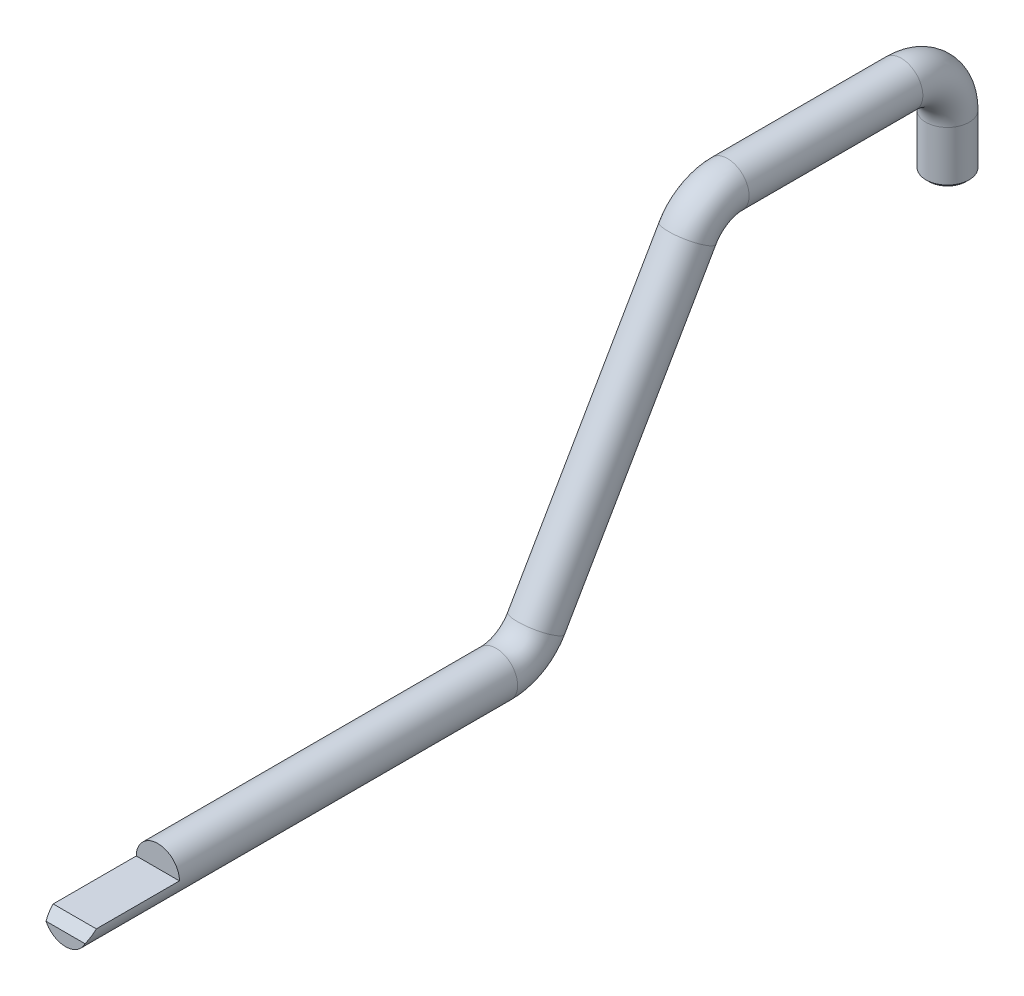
ISO-10303-21;
HEADER;
FILE_DESCRIPTION(('STEP AP214'),'2;1');
FILE_NAME('part.step','',(''),(''),'','','');
FILE_SCHEMA(('AUTOMOTIVE_DESIGN { 1 0 10303 214 1 1 1 1 }'));
ENDSEC;
DATA;
#1=APPLICATION_CONTEXT('core data for automotive mechanical design processes');
#2=APPLICATION_PROTOCOL_DEFINITION('international standard','automotive_design',2000,#1);
#3=PRODUCT_CONTEXT('',#1,'mechanical');
#4=PRODUCT('Part','Part','',(#3));
#5=PRODUCT_RELATED_PRODUCT_CATEGORY('part','',(#4));
#6=PRODUCT_DEFINITION_FORMATION('','',#4);
#7=PRODUCT_DEFINITION_CONTEXT('part definition',#1,'design');
#8=PRODUCT_DEFINITION('design','',#6,#7);
#9=PRODUCT_DEFINITION_SHAPE('','',#8);
#10=(LENGTH_UNIT() NAMED_UNIT(*) SI_UNIT(.MILLI.,.METRE.));
#11=(NAMED_UNIT(*) PLANE_ANGLE_UNIT() SI_UNIT($,.RADIAN.));
#12=(NAMED_UNIT(*) SI_UNIT($,.STERADIAN.) SOLID_ANGLE_UNIT());
#13=UNCERTAINTY_MEASURE_WITH_UNIT(LENGTH_MEASURE(1.E-05),#10,'distance_accuracy_value','');
#14=(GEOMETRIC_REPRESENTATION_CONTEXT(3) GLOBAL_UNCERTAINTY_ASSIGNED_CONTEXT((#13)) GLOBAL_UNIT_ASSIGNED_CONTEXT((#10,
#11,#12)) REPRESENTATION_CONTEXT('',''));
#15=CARTESIAN_POINT('',(0.,0.,0.));
#16=DIRECTION('',(0.,0.,1.));
#17=DIRECTION('',(1.,0.,0.));
#18=AXIS2_PLACEMENT_3D('',#15,#16,#17);
#19=CARTESIAN_POINT('',(341.592830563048,73.9472469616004,-243.207491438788));
#20=DIRECTION('',(0.,0.,1.));
#21=DIRECTION('',(0.,-1.,0.));
#22=AXIS2_PLACEMENT_3D('',#19,#20,#21);
#23=CYLINDRICAL_SURFACE('',#22,11.1125);
#24=CARTESIAN_POINT('',(341.592830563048,73.9472469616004,-243.207491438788));
#25=DIRECTION('',(0.,0.,-1.));
#26=DIRECTION('',(0.,1.,0.));
#27=AXIS2_PLACEMENT_3D('',#24,#25,#26);
#28=CIRCLE('',#27,11.1125);
#29=CARTESIAN_POINT('',(341.592830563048,62.8347469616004,-243.207491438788));
#30=VERTEX_POINT('',#29);
#31=EDGE_CURVE('E87',#30,#30,#28,.T.);
#32=ORIENTED_EDGE('',*,*,#31,.F.);
#33=EDGE_LOOP('',(#32));
#34=FACE_BOUND('',#33,.T.);
#35=DIRECTION('',(0.,0.,1.));
#36=VECTOR('',#35,1.);
#37=CARTESIAN_POINT('',(352.705330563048,73.9472469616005,-243.207491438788));
#38=LINE('',#37,#36);
#39=CARTESIAN_POINT('',(352.705330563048,73.9472469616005,-26.3093999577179));
#40=VERTEX_POINT('',#39);
#41=CARTESIAN_POINT('',(352.705330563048,73.9472469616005,-69.0829999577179));
#42=VERTEX_POINT('',#41);
#43=EDGE_CURVE('E67',#40,#42,#38,.F.);
#44=ORIENTED_EDGE('',*,*,#43,.F.);
#45=CARTESIAN_POINT('',(341.592830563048,73.9472469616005,-26.3093999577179));
#46=DIRECTION('',(0.,0.707106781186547,0.707106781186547));
#47=DIRECTION('',(0.,-0.707106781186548,0.707106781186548));
#48=AXIS2_PLACEMENT_3D('',#45,#46,#47);
#49=ELLIPSE('',#48,15.715448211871,11.1125);
#50=CARTESIAN_POINT('',(351.633062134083,69.1847469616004,-21.5468999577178));
#51=VERTEX_POINT('',#50);
#52=EDGE_CURVE('E43',#40,#51,#49,.F.);
#53=ORIENTED_EDGE('',*,*,#52,.T.);
#54=CARTESIAN_POINT('',(341.592830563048,73.9472469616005,-21.5468999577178));
#55=DIRECTION('',(0.,0.,-1.));
#56=DIRECTION('',(0.,1.,0.));
#57=AXIS2_PLACEMENT_3D('',#54,#55,#56);
#58=CIRCLE('',#57,11.1125);
#59=CARTESIAN_POINT('',(331.552598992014,69.1847469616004,-21.5468999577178));
#60=VERTEX_POINT('',#59);
#61=EDGE_CURVE('E86',#51,#60,#58,.T.);
#62=ORIENTED_EDGE('',*,*,#61,.T.);
#63=CARTESIAN_POINT('',(341.592830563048,73.9472469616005,-26.3093999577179));
#64=DIRECTION('',(0.,0.707106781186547,0.707106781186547));
#65=DIRECTION('',(0.,-0.707106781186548,0.707106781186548));
#66=AXIS2_PLACEMENT_3D('',#63,#64,#65);
#67=ELLIPSE('',#66,15.715448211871,11.1125);
#68=CARTESIAN_POINT('',(330.480330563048,73.9472469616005,-26.3093999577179));
#69=VERTEX_POINT('',#68);
#70=EDGE_CURVE('E112',#60,#69,#67,.F.);
#71=ORIENTED_EDGE('',*,*,#70,.T.);
#72=DIRECTION('',(0.,0.,1.));
#73=VECTOR('',#72,1.);
#74=CARTESIAN_POINT('',(330.480330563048,73.9472469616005,-243.207491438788));
#75=LINE('',#74,#73);
#76=CARTESIAN_POINT('',(330.480330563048,73.9472469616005,-69.0829999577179));
#77=VERTEX_POINT('',#76);
#78=EDGE_CURVE('E75',#77,#69,#75,.T.);
#79=ORIENTED_EDGE('',*,*,#78,.F.);
#80=CARTESIAN_POINT('',(341.592830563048,73.9472469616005,-69.0829999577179));
#81=DIRECTION('',(0.,0.,1.));
#82=DIRECTION('',(1.,0.,0.));
#83=AXIS2_PLACEMENT_3D('',#80,#81,#82);
#84=CIRCLE('',#83,11.1125);
#85=EDGE_CURVE('E78',#42,#77,#84,.T.);
#86=ORIENTED_EDGE('',*,*,#85,.F.);
#87=EDGE_LOOP('',(#44,#53,#62,#71,#79,#86));
#88=FACE_BOUND('',#87,.T.);
#89=ADVANCED_FACE('F35',(#34,#88),#23,.T.);
#90=CARTESIAN_POINT('',(341.592830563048,73.9472469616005,-21.5468999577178));
#91=DIRECTION('',(0.,0.,-1.));
#92=DIRECTION('',(0.,1.,0.));
#93=AXIS2_PLACEMENT_3D('',#90,#91,#92);
#94=PLANE('',#93);
#95=ORIENTED_EDGE('',*,*,#61,.F.);
#96=DIRECTION('',(-1.,0.,0.));
#97=VECTOR('',#96,1.);
#98=CARTESIAN_POINT('',(330.480330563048,69.1847469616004,-21.5468999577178));
#99=LINE('',#98,#97);
#100=EDGE_CURVE('E11',#51,#60,#99,.T.);
#101=ORIENTED_EDGE('',*,*,#100,.T.);
#102=EDGE_LOOP('',(#95,#101));
#103=FACE_BOUND('',#102,.T.);
#104=ADVANCED_FACE('F121',(#103),#94,.F.);
#105=CARTESIAN_POINT('',(341.592830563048,208.8847469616,-475.609999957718));
#106=DIRECTION('',(0.,-1.,0.));
#107=DIRECTION('',(0.,0.,-1.));
#108=AXIS2_PLACEMENT_3D('',#105,#106,#107);
#109=CYLINDRICAL_SURFACE('',#108,11.1125);
#110=CARTESIAN_POINT('',(341.592830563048,183.2307469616,-475.609999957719));
#111=DIRECTION('',(0.,-1.,0.));
#112=DIRECTION('',(0.,0.,-1.));
#113=AXIS2_PLACEMENT_3D('',#110,#111,#112);
#114=CIRCLE('',#113,11.1125);
#115=CARTESIAN_POINT('',(341.592830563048,183.2307469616,-464.497499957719));
#116=VERTEX_POINT('',#115);
#117=EDGE_CURVE('E80',#116,#116,#114,.F.);
#118=ORIENTED_EDGE('',*,*,#117,.T.);
#119=EDGE_LOOP('',(#118));
#120=FACE_BOUND('',#119,.T.);
#121=CARTESIAN_POINT('',(341.592830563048,208.8847469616,-475.609999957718));
#122=DIRECTION('',(0.,-1.,0.));
#123=DIRECTION('',(0.,0.,-1.));
#124=AXIS2_PLACEMENT_3D('',#121,#122,#123);
#125=CIRCLE('',#124,11.1125);
#126=CARTESIAN_POINT('',(341.592830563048,208.8847469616,-486.722499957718));
#127=VERTEX_POINT('',#126);
#128=EDGE_CURVE('E102',#127,#127,#125,.T.);
#129=ORIENTED_EDGE('',*,*,#128,.T.);
#130=EDGE_LOOP('',(#129));
#131=FACE_BOUND('',#130,.T.);
#132=ADVANCED_FACE('F127',(#120,#131),#109,.T.);
#133=CARTESIAN_POINT('',(341.592830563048,208.8847469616,-451.797499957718));
#134=DIRECTION('',(-1.,0.,0.));
#135=DIRECTION('',(0.,0.,1.));
#136=AXIS2_PLACEMENT_3D('',#133,#134,#135);
#137=TOROIDAL_SURFACE('',#136,23.8125,11.1125);
#138=CARTESIAN_POINT('',(341.592830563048,232.6972469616,-451.797499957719));
#139=DIRECTION('',(0.,0.,-1.));
#140=DIRECTION('',(0.,1.,0.));
#141=AXIS2_PLACEMENT_3D('',#138,#139,#140);
#142=CIRCLE('',#141,11.1125);
#143=CARTESIAN_POINT('',(341.592830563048,243.8097469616,-451.797499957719));
#144=VERTEX_POINT('',#143);
#145=EDGE_CURVE('E99',#144,#144,#142,.T.);
#146=CARTESIAN_POINT('',(341.592830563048,208.8847469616,-451.797499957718));
#147=DIRECTION('',(-1.,0.,0.));
#148=DIRECTION('',(0.,0.,1.));
#149=AXIS2_PLACEMENT_3D('',#146,#147,#148);
#150=CIRCLE('',#149,34.925);
#151=EDGE_CURVE('',#144,#127,#150,.T.);
#152=ORIENTED_EDGE('',*,*,#145,.T.);
#153=ORIENTED_EDGE('',*,*,#128,.F.);
#154=ORIENTED_EDGE('',*,*,#151,.T.);
#155=ORIENTED_EDGE('',*,*,#151,.F.);
#156=EDGE_LOOP('',(#152,#154,#153,#155));
#157=FACE_BOUND('',#156,.T.);
#158=ADVANCED_FACE('F147',(#157),#137,.T.);
#159=CARTESIAN_POINT('',(341.592830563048,232.6972469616,-362.358153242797));
#160=DIRECTION('',(0.,0.,-1.));
#161=DIRECTION('',(0.,1.,0.));
#162=AXIS2_PLACEMENT_3D('',#159,#160,#161);
#163=CYLINDRICAL_SURFACE('',#162,11.1125);
#164=CARTESIAN_POINT('',(341.592830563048,232.6972469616,-362.358153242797));
#165=DIRECTION('',(0.,0.,-1.));
#166=DIRECTION('',(0.,1.,0.));
#167=AXIS2_PLACEMENT_3D('',#164,#165,#166);
#168=CIRCLE('',#167,11.1125);
#169=CARTESIAN_POINT('',(341.592830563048,243.8097469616,-362.358153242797));
#170=VERTEX_POINT('',#169);
#171=EDGE_CURVE('E96',#170,#170,#168,.T.);
#172=ORIENTED_EDGE('',*,*,#171,.T.);
#173=EDGE_LOOP('',(#172));
#174=FACE_BOUND('',#173,.T.);
#175=ORIENTED_EDGE('',*,*,#145,.F.);
#176=EDGE_LOOP('',(#175));
#177=FACE_BOUND('',#176,.T.);
#178=ADVANCED_FACE('F143',(#174,#177),#163,.T.);
#179=CARTESIAN_POINT('',(341.592830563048,208.8847469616,-362.358153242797));
#180=DIRECTION('',(-1.,0.,0.));
#181=DIRECTION('',(0.,0.,1.));
#182=AXIS2_PLACEMENT_3D('',#179,#180,#181);
#183=TOROIDAL_SURFACE('',#182,23.8125,11.1125);
#184=CARTESIAN_POINT('',(341.592830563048,220.7909969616,-341.73592331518));
#185=DIRECTION('',(0.,0.866025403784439,-0.499999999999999));
#186=DIRECTION('',(0.,0.499999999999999,0.866025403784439));
#187=AXIS2_PLACEMENT_3D('',#184,#185,#186);
#188=CIRCLE('',#187,11.1125);
#189=CARTESIAN_POINT('',(341.592830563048,226.3472469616,-332.112216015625));
#190=VERTEX_POINT('',#189);
#191=EDGE_CURVE('E93',#190,#190,#188,.T.);
#192=CARTESIAN_POINT('',(341.592830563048,208.8847469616,-362.358153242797));
#193=DIRECTION('',(-1.,0.,0.));
#194=DIRECTION('',(0.,0.,1.));
#195=AXIS2_PLACEMENT_3D('',#192,#193,#194);
#196=CIRCLE('',#195,34.925);
#197=EDGE_CURVE('',#190,#170,#196,.T.);
#198=ORIENTED_EDGE('',*,*,#191,.T.);
#199=ORIENTED_EDGE('',*,*,#171,.F.);
#200=ORIENTED_EDGE('',*,*,#197,.T.);
#201=ORIENTED_EDGE('',*,*,#197,.F.);
#202=EDGE_LOOP('',(#198,#200,#199,#201));
#203=FACE_BOUND('',#202,.T.);
#204=ADVANCED_FACE('F139',(#203),#183,.T.);
#205=CARTESIAN_POINT('',(341.592830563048,85.8534969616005,-263.829721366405));
#206=DIRECTION('',(0.,0.86602540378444,-0.499999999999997));
#207=DIRECTION('',(0.,0.499999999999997,0.86602540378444));
#208=AXIS2_PLACEMENT_3D('',#205,#206,#207);
#209=CYLINDRICAL_SURFACE('',#208,11.1125);
#210=CARTESIAN_POINT('',(341.592830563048,85.8534969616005,-263.829721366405));
#211=DIRECTION('',(0.,0.866025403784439,-0.499999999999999));
#212=DIRECTION('',(0.,0.499999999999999,0.866025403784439));
#213=AXIS2_PLACEMENT_3D('',#210,#211,#212);
#214=CIRCLE('',#213,11.1125);
#215=CARTESIAN_POINT('',(341.592830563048,80.2972469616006,-273.45342866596));
#216=VERTEX_POINT('',#215);
#217=EDGE_CURVE('E90',#216,#216,#214,.T.);
#218=ORIENTED_EDGE('',*,*,#217,.T.);
#219=EDGE_LOOP('',(#218));
#220=FACE_BOUND('',#219,.T.);
#221=ORIENTED_EDGE('',*,*,#191,.F.);
#222=EDGE_LOOP('',(#221));
#223=FACE_BOUND('',#222,.T.);
#224=ADVANCED_FACE('F135',(#220,#223),#209,.T.);
#225=CARTESIAN_POINT('',(341.592830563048,97.7597469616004,-243.207491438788));
#226=DIRECTION('',(1.,0.,0.));
#227=DIRECTION('',(0.,0.,-1.));
#228=AXIS2_PLACEMENT_3D('',#225,#226,#227);
#229=TOROIDAL_SURFACE('',#228,23.8125,11.1125);
#230=CARTESIAN_POINT('',(341.592830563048,97.7597469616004,-243.207491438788));
#231=DIRECTION('',(1.,0.,0.));
#232=DIRECTION('',(0.,0.,-1.));
#233=AXIS2_PLACEMENT_3D('',#230,#231,#232);
#234=CIRCLE('',#233,34.925);
#235=EDGE_CURVE('',#30,#216,#234,.T.);
#236=ORIENTED_EDGE('',*,*,#31,.T.);
#237=ORIENTED_EDGE('',*,*,#217,.F.);
#238=ORIENTED_EDGE('',*,*,#235,.T.);
#239=ORIENTED_EDGE('',*,*,#235,.F.);
#240=EDGE_LOOP('',(#236,#238,#237,#239));
#241=FACE_BOUND('',#240,.T.);
#242=ADVANCED_FACE('F132',(#241),#229,.T.);
#243=CARTESIAN_POINT('',(341.592830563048,181.6432469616,-475.609999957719));
#244=DIRECTION('',(0.,-1.,0.));
#245=DIRECTION('',(0.,0.,-1.));
#246=AXIS2_PLACEMENT_3D('',#243,#244,#245);
#247=PLANE('',#246);
#248=CARTESIAN_POINT('',(341.592830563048,181.6432469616,-475.609999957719));
#249=DIRECTION('',(0.,-1.,0.));
#250=DIRECTION('',(0.,0.,-1.));
#251=AXIS2_PLACEMENT_3D('',#248,#249,#250);
#252=CIRCLE('',#251,9.52500000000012);
#253=CARTESIAN_POINT('',(341.592830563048,181.6432469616,-466.084999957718));
#254=VERTEX_POINT('',#253);
#255=EDGE_CURVE('E105',#254,#254,#252,.T.);
#256=ORIENTED_EDGE('',*,*,#255,.T.);
#257=EDGE_LOOP('',(#256));
#258=FACE_BOUND('',#257,.T.);
#259=ADVANCED_FACE('F131',(#258),#247,.T.);
#260=CARTESIAN_POINT('',(341.592830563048,181.6432469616,-475.609999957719));
#261=DIRECTION('',(0.,1.,0.));
#262=DIRECTION('',(0.,0.,1.));
#263=AXIS2_PLACEMENT_3D('',#260,#261,#262);
#264=CONICAL_SURFACE('',#263,9.52500000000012,0.785398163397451);
#265=CARTESIAN_POINT('',(341.592830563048,183.2307469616,-464.497499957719));
#266=CARTESIAN_POINT('',(341.592830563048,183.214210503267,-464.514036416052));
#267=CARTESIAN_POINT('',(341.592830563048,183.197674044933,-464.530572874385));
#268=CARTESIAN_POINT('',(341.592830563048,183.164601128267,-464.563645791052));
#269=CARTESIAN_POINT('',(341.592830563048,183.148064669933,-464.580182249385));
#270=CARTESIAN_POINT('',(341.592830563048,183.114991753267,-464.613255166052));
#271=CARTESIAN_POINT('',(341.592830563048,183.098455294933,-464.629791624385));
#272=CARTESIAN_POINT('',(341.592830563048,183.065382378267,-464.662864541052));
#273=CARTESIAN_POINT('',(341.592830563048,183.048845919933,-464.679400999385));
#274=CARTESIAN_POINT('',(341.592830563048,183.015773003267,-464.712473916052));
#275=CARTESIAN_POINT('',(341.592830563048,182.999236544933,-464.729010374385));
#276=CARTESIAN_POINT('',(341.592830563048,182.966163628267,-464.762083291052));
#277=CARTESIAN_POINT('',(341.592830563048,182.949627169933,-464.778619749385));
#278=CARTESIAN_POINT('',(341.592830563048,182.916554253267,-464.811692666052));
#279=CARTESIAN_POINT('',(341.592830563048,182.900017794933,-464.828229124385));
#280=CARTESIAN_POINT('',(341.592830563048,182.866944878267,-464.861302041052));
#281=CARTESIAN_POINT('',(341.592830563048,182.850408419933,-464.877838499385));
#282=CARTESIAN_POINT('',(341.592830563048,182.817335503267,-464.910911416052));
#283=CARTESIAN_POINT('',(341.592830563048,182.800799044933,-464.927447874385));
#284=CARTESIAN_POINT('',(341.592830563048,182.767726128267,-464.960520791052));
#285=CARTESIAN_POINT('',(341.592830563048,182.751189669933,-464.977057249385));
#286=CARTESIAN_POINT('',(341.592830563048,182.718116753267,-465.010130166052));
#287=CARTESIAN_POINT('',(341.592830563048,182.701580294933,-465.026666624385));
#288=CARTESIAN_POINT('',(341.592830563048,182.668507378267,-465.059739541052));
#289=CARTESIAN_POINT('',(341.592830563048,182.651970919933,-465.076275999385));
#290=CARTESIAN_POINT('',(341.592830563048,182.618898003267,-465.109348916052));
#291=CARTESIAN_POINT('',(341.592830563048,182.602361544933,-465.125885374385));
#292=CARTESIAN_POINT('',(341.592830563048,182.569288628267,-465.158958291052));
#293=CARTESIAN_POINT('',(341.592830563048,182.552752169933,-465.175494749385));
#294=CARTESIAN_POINT('',(341.592830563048,182.519679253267,-465.208567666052));
#295=CARTESIAN_POINT('',(341.592830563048,182.503142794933,-465.225104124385));
#296=CARTESIAN_POINT('',(341.592830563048,182.470069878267,-465.258177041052));
#297=CARTESIAN_POINT('',(341.592830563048,182.453533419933,-465.274713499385));
#298=CARTESIAN_POINT('',(341.592830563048,182.420460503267,-465.307786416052));
#299=CARTESIAN_POINT('',(341.592830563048,182.403924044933,-465.324322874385));
#300=CARTESIAN_POINT('',(341.592830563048,182.370851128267,-465.357395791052));
#301=CARTESIAN_POINT('',(341.592830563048,182.354314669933,-465.373932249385));
#302=CARTESIAN_POINT('',(341.592830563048,182.321241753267,-465.407005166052));
#303=CARTESIAN_POINT('',(341.592830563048,182.304705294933,-465.423541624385));
#304=CARTESIAN_POINT('',(341.592830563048,182.271632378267,-465.456614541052));
#305=CARTESIAN_POINT('',(341.592830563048,182.255095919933,-465.473150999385));
#306=CARTESIAN_POINT('',(341.592830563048,182.222023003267,-465.506223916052));
#307=CARTESIAN_POINT('',(341.592830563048,182.205486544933,-465.522760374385));
#308=CARTESIAN_POINT('',(341.592830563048,182.172413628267,-465.555833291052));
#309=CARTESIAN_POINT('',(341.592830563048,182.155877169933,-465.572369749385));
#310=CARTESIAN_POINT('',(341.592830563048,182.122804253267,-465.605442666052));
#311=CARTESIAN_POINT('',(341.592830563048,182.106267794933,-465.621979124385));
#312=CARTESIAN_POINT('',(341.592830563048,182.073194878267,-465.655052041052));
#313=CARTESIAN_POINT('',(341.592830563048,182.056658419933,-465.671588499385));
#314=CARTESIAN_POINT('',(341.592830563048,182.023585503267,-465.704661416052));
#315=CARTESIAN_POINT('',(341.592830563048,182.007049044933,-465.721197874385));
#316=CARTESIAN_POINT('',(341.592830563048,181.973976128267,-465.754270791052));
#317=CARTESIAN_POINT('',(341.592830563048,181.957439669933,-465.770807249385));
#318=CARTESIAN_POINT('',(341.592830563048,181.924366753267,-465.803880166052));
#319=CARTESIAN_POINT('',(341.592830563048,181.907830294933,-465.820416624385));
#320=CARTESIAN_POINT('',(341.592830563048,181.874757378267,-465.853489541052));
#321=CARTESIAN_POINT('',(341.592830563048,181.858220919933,-465.870025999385));
#322=CARTESIAN_POINT('',(341.592830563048,181.825148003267,-465.903098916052));
#323=CARTESIAN_POINT('',(341.592830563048,181.808611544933,-465.919635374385));
#324=CARTESIAN_POINT('',(341.592830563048,181.775538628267,-465.952708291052));
#325=CARTESIAN_POINT('',(341.592830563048,181.759002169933,-465.969244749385));
#326=CARTESIAN_POINT('',(341.592830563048,181.725929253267,-466.002317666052));
#327=CARTESIAN_POINT('',(341.592830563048,181.709392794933,-466.018854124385));
#328=CARTESIAN_POINT('',(341.592830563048,181.676319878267,-466.051927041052));
#329=CARTESIAN_POINT('',(341.592830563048,181.659783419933,-466.068463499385));
#330=CARTESIAN_POINT('',(341.592830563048,181.6432469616,-466.084999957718));
#331=B_SPLINE_CURVE_WITH_KNOTS('',3,(#265,#266,#267,#268,#269,#270,#271,#272,#273,#274,#275,
#276,#277,#278,#279,#280,#281,#282,#283,#284,#285,#286,#287,#288,#289,#290,#291,#292,#293,#294,
#295,#296,#297,#298,#299,#300,#301,#302,#303,#304,#305,#306,#307,#308,#309,#310,#311,#312,#313,
#314,#315,#316,#317,#318,#319,#320,#321,#322,#323,#324,#325,#326,#327,#328,#329,#330),
.UNSPECIFIED.,.F.,.F.,(4,2,2,2,2,2,2,2,2,2,2,2,2,2,2,2,2,2,2,2,2,2,2,2,2,2,2,2,2,2,2,2,4),(0.,
0.0701582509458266,0.140316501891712,0.210474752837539,0.280633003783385,0.350791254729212,
0.420949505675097,0.491107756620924,0.56126600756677,0.631424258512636,0.701582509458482,
0.771740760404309,0.841899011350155,0.912057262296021,0.982215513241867,1.05237376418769,
1.12253201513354,1.19269026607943,1.26284851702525,1.3330067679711,1.40316501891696,
1.47332326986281,1.54348152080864,1.61363977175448,1.68379802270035,1.7539562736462,
1.82411452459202,1.89427277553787,1.96443102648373,2.03458927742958,2.10474752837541,
2.17490577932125,2.24506403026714),.UNSPECIFIED.);
#332=EDGE_CURVE('BSEAM155',#116,#254,#331,.T.);
#333=ORIENTED_EDGE('',*,*,#117,.F.);
#334=ORIENTED_EDGE('',*,*,#255,.F.);
#335=ORIENTED_EDGE('',*,*,#332,.T.);
#336=ORIENTED_EDGE('',*,*,#332,.F.);
#337=EDGE_LOOP('',(#333,#335,#334,#336));
#338=FACE_BOUND('',#337,.T.);
#339=ADVANCED_FACE('F155',(#338),#264,.T.);
#340=CARTESIAN_POINT('',(1244.80999724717,73.9472469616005,-69.0829999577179));
#341=DIRECTION('',(0.,0.,1.));
#342=DIRECTION('',(1.,0.,0.));
#343=AXIS2_PLACEMENT_3D('',#340,#341,#342);
#344=PLANE('',#343);
#345=DIRECTION('',(-1.,0.,0.));
#346=VECTOR('',#345,1.);
#347=CARTESIAN_POINT('',(1244.80999724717,73.9472469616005,-69.0829999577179));
#348=LINE('',#347,#346);
#349=EDGE_CURVE('E72',#42,#77,#348,.T.);
#350=ORIENTED_EDGE('',*,*,#349,.F.);
#351=ORIENTED_EDGE('',*,*,#85,.T.);
#352=EDGE_LOOP('',(#350,#351));
#353=FACE_BOUND('',#352,.T.);
#354=ADVANCED_FACE('F82',(#353),#344,.T.);
#355=CARTESIAN_POINT('',(1244.80999724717,73.9472469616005,-14.3397478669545));
#356=DIRECTION('',(0.,1.,0.));
#357=DIRECTION('',(0.,0.,1.));
#358=AXIS2_PLACEMENT_3D('',#355,#356,#357);
#359=PLANE('',#358);
#360=ORIENTED_EDGE('',*,*,#78,.T.);
#361=DIRECTION('',(1.,0.,0.));
#362=VECTOR('',#361,1.);
#363=CARTESIAN_POINT('',(352.705330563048,73.9472469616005,-26.3093999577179));
#364=LINE('',#363,#362);
#365=EDGE_CURVE('E74',#69,#40,#364,.T.);
#366=ORIENTED_EDGE('',*,*,#365,.T.);
#367=ORIENTED_EDGE('',*,*,#43,.T.);
#368=ORIENTED_EDGE('',*,*,#349,.T.);
#369=EDGE_LOOP('',(#360,#366,#367,#368));
#370=FACE_BOUND('',#369,.T.);
#371=ADVANCED_FACE('F70',(#370),#359,.T.);
#372=CARTESIAN_POINT('',(1244.80999724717,73.9472469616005,-26.3093999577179));
#373=DIRECTION('',(0.,0.707106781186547,0.707106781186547));
#374=DIRECTION('',(-1.,0.,0.));
#375=AXIS2_PLACEMENT_3D('',#372,#373,#374);
#376=PLANE('',#375);
#377=ORIENTED_EDGE('',*,*,#70,.F.);
#378=ORIENTED_EDGE('',*,*,#100,.F.);
#379=ORIENTED_EDGE('',*,*,#52,.F.);
#380=ORIENTED_EDGE('',*,*,#365,.F.);
#381=EDGE_LOOP('',(#377,#378,#379,#380));
#382=FACE_BOUND('',#381,.T.);
#383=ADVANCED_FACE('F37',(#382),#376,.T.);
#384=CLOSED_SHELL('',(#89,#104,#132,#158,#178,#204,#224,#242,#259,#339,#354,#371,#383));
#385=MANIFOLD_SOLID_BREP('B2',#384);
#386=ADVANCED_BREP_SHAPE_REPRESENTATION('',(#18,#385),#14);
#387=SHAPE_DEFINITION_REPRESENTATION(#9,#386);
ENDSEC;
END-ISO-10303-21;
